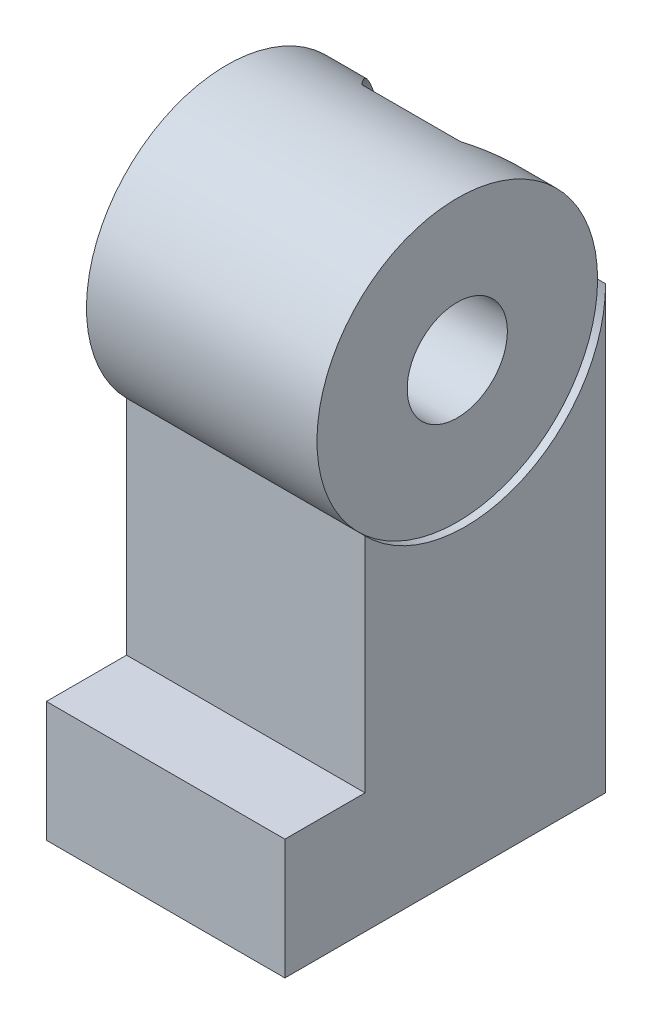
ISO-10303-21;
HEADER;
FILE_DESCRIPTION(('STEP AP214'),'2;1');
FILE_NAME('part.step','',(''),(''),'','','');
FILE_SCHEMA(('AUTOMOTIVE_DESIGN { 1 0 10303 214 1 1 1 1 }'));
ENDSEC;
DATA;
#1=APPLICATION_CONTEXT('core data for automotive mechanical design processes');
#2=APPLICATION_PROTOCOL_DEFINITION('international standard','automotive_design',2000,#1);
#3=PRODUCT_CONTEXT('',#1,'mechanical');
#4=PRODUCT('Part','Part','',(#3));
#5=PRODUCT_RELATED_PRODUCT_CATEGORY('part','',(#4));
#6=PRODUCT_DEFINITION_FORMATION('','',#4);
#7=PRODUCT_DEFINITION_CONTEXT('part definition',#1,'design');
#8=PRODUCT_DEFINITION('design','',#6,#7);
#9=PRODUCT_DEFINITION_SHAPE('','',#8);
#10=(LENGTH_UNIT() NAMED_UNIT(*) SI_UNIT(.MILLI.,.METRE.));
#11=(NAMED_UNIT(*) PLANE_ANGLE_UNIT() SI_UNIT($,.RADIAN.));
#12=(NAMED_UNIT(*) SI_UNIT($,.STERADIAN.) SOLID_ANGLE_UNIT());
#13=UNCERTAINTY_MEASURE_WITH_UNIT(LENGTH_MEASURE(1.E-05),#10,'distance_accuracy_value','');
#14=(GEOMETRIC_REPRESENTATION_CONTEXT(3) GLOBAL_UNCERTAINTY_ASSIGNED_CONTEXT((#13)) GLOBAL_UNIT_ASSIGNED_CONTEXT((#10,
#11,#12)) REPRESENTATION_CONTEXT('',''));
#15=CARTESIAN_POINT('',(0.,0.,0.));
#16=DIRECTION('',(0.,0.,1.));
#17=DIRECTION('',(1.,0.,0.));
#18=AXIS2_PLACEMENT_3D('',#15,#16,#17);
#19=CARTESIAN_POINT('',(-0.725,11.,-0.5));
#20=DIRECTION('',(1.,0.,0.));
#21=DIRECTION('',(0.,1.,0.));
#22=AXIS2_PLACEMENT_3D('',#19,#20,#21);
#23=PLANE('',#22);
#24=CARTESIAN_POINT('',(-0.725,11.,-0.5));
#25=DIRECTION('',(1.,0.,0.));
#26=DIRECTION('',(0.,0.,-1.));
#27=AXIS2_PLACEMENT_3D('',#24,#25,#26);
#28=CIRCLE('',#27,1.25);
#29=CARTESIAN_POINT('',(-0.725,11.,-1.75));
#30=VERTEX_POINT('',#29);
#31=EDGE_CURVE('E196',#30,#30,#28,.T.);
#32=ORIENTED_EDGE('',*,*,#31,.T.);
#33=EDGE_LOOP('',(#32));
#34=FACE_BOUND('',#33,.T.);
#35=ADVANCED_FACE('F17',(#34),#23,.T.);
#36=CARTESIAN_POINT('',(2.775,11.,-0.5));
#37=DIRECTION('',(1.,0.,0.));
#38=DIRECTION('',(0.,1.,0.));
#39=AXIS2_PLACEMENT_3D('',#36,#37,#38);
#40=PLANE('',#39);
#41=CARTESIAN_POINT('',(2.775,11.,-0.5));
#42=DIRECTION('',(1.,0.,0.));
#43=DIRECTION('',(0.,0.,-1.));
#44=AXIS2_PLACEMENT_3D('',#41,#42,#43);
#45=CIRCLE('',#44,1.25);
#46=CARTESIAN_POINT('',(2.775,11.,-1.75));
#47=VERTEX_POINT('',#46);
#48=EDGE_CURVE('E192',#47,#47,#45,.T.);
#49=ORIENTED_EDGE('',*,*,#48,.F.);
#50=EDGE_LOOP('',(#49));
#51=FACE_BOUND('',#50,.T.);
#52=CARTESIAN_POINT('',(2.775,11.,-0.5));
#53=DIRECTION('',(1.,0.,0.));
#54=DIRECTION('',(0.,0.,-1.));
#55=AXIS2_PLACEMENT_3D('',#52,#53,#54);
#56=CIRCLE('',#55,3.5);
#57=CARTESIAN_POINT('',(2.775,11.,-4.));
#58=VERTEX_POINT('',#57);
#59=CARTESIAN_POINT('',(2.775,8.55051025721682,2.));
#60=VERTEX_POINT('',#59);
#61=EDGE_CURVE('E328',#58,#60,#56,.T.);
#62=ORIENTED_EDGE('',*,*,#61,.T.);
#63=CARTESIAN_POINT('',(2.775,11.,-0.5));
#64=DIRECTION('',(1.,0.,0.));
#65=DIRECTION('',(0.,0.,-1.));
#66=AXIS2_PLACEMENT_3D('',#63,#64,#65);
#67=CIRCLE('',#66,3.5);
#68=EDGE_CURVE('E11',#60,#58,#67,.T.);
#69=ORIENTED_EDGE('',*,*,#68,.T.);
#70=EDGE_LOOP('',(#62,#69));
#71=FACE_BOUND('',#70,.T.);
#72=ADVANCED_FACE('F19',(#51,#71),#40,.T.);
#73=CARTESIAN_POINT('',(2.775,11.,-0.5));
#74=DIRECTION('',(1.,0.,0.));
#75=DIRECTION('',(0.,0.,-1.));
#76=AXIS2_PLACEMENT_3D('',#73,#74,#75);
#77=CYLINDRICAL_SURFACE('',#76,3.5);
#78=CARTESIAN_POINT('',(2.975,11.,-0.5));
#79=DIRECTION('',(1.,0.,0.));
#80=DIRECTION('',(0.,0.,-1.));
#81=AXIS2_PLACEMENT_3D('',#78,#79,#80);
#82=CIRCLE('',#81,3.5);
#83=CARTESIAN_POINT('',(2.975,8.55051025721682,2.));
#84=VERTEX_POINT('',#83);
#85=CARTESIAN_POINT('',(2.975,11.,-4.));
#86=VERTEX_POINT('',#85);
#87=EDGE_CURVE('E43',#84,#86,#82,.T.);
#88=ORIENTED_EDGE('',*,*,#87,.T.);
#89=DIRECTION('',(-1.,0.,0.));
#90=VECTOR('',#89,1.);
#91=CARTESIAN_POINT('',(2.975,11.,-4.));
#92=LINE('',#91,#90);
#93=EDGE_CURVE('E206',#86,#58,#92,.T.);
#94=ORIENTED_EDGE('',*,*,#93,.T.);
#95=ORIENTED_EDGE('',*,*,#68,.F.);
#96=DIRECTION('',(-1.,0.,0.));
#97=VECTOR('',#96,1.);
#98=CARTESIAN_POINT('',(2.975,8.55051025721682,2.));
#99=LINE('',#98,#97);
#100=EDGE_CURVE('E151',#84,#60,#99,.T.);
#101=ORIENTED_EDGE('',*,*,#100,.F.);
#102=EDGE_LOOP('',(#88,#94,#95,#101));
#103=FACE_BOUND('',#102,.T.);
#104=ADVANCED_FACE('F152',(#103),#77,.F.);
#105=CARTESIAN_POINT('',(0.,1.8,0.));
#106=DIRECTION('',(0.,-1.,0.));
#107=DIRECTION('',(0.,0.,-1.));
#108=AXIS2_PLACEMENT_3D('',#105,#106,#107);
#109=PLANE('',#108);
#110=DIRECTION('',(0.,0.,-1.));
#111=VECTOR('',#110,1.);
#112=CARTESIAN_POINT('',(0.884166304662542,1.8,-2.2));
#113=LINE('',#112,#111);
#114=CARTESIAN_POINT('',(0.884166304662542,1.8,-2.2));
#115=VERTEX_POINT('',#114);
#116=CARTESIAN_POINT('',(0.884166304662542,1.8,-2.23119921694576));
#117=VERTEX_POINT('',#116);
#118=EDGE_CURVE('E346',#115,#117,#113,.T.);
#119=ORIENTED_EDGE('',*,*,#118,.T.);
#120=CARTESIAN_POINT('',(0.,1.8,0.));
#121=DIRECTION('',(0.,-1.,0.));
#122=DIRECTION('',(0.,0.,-1.));
#123=AXIS2_PLACEMENT_3D('',#120,#121,#122);
#124=CIRCLE('',#123,2.4);
#125=CARTESIAN_POINT('',(-0.95916630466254,1.8,-2.2));
#126=VERTEX_POINT('',#125);
#127=EDGE_CURVE('E393',#117,#126,#124,.T.);
#128=ORIENTED_EDGE('',*,*,#127,.T.);
#129=DIRECTION('',(-1.,0.,0.));
#130=VECTOR('',#129,1.);
#131=CARTESIAN_POINT('',(-0.075,1.8,-2.2));
#132=LINE('',#131,#130);
#133=EDGE_CURVE('E146',#115,#126,#132,.T.);
#134=ORIENTED_EDGE('',*,*,#133,.F.);
#135=EDGE_LOOP('',(#119,#128,#134));
#136=FACE_BOUND('',#135,.T.);
#137=ADVANCED_FACE('F283',(#136),#109,.T.);
#138=CARTESIAN_POINT('',(-0.075,12.,-2.2));
#139=DIRECTION('',(0.,0.,-1.));
#140=DIRECTION('',(0.,1.,0.));
#141=AXIS2_PLACEMENT_3D('',#138,#139,#140);
#142=CYLINDRICAL_SURFACE('',#141,2.4);
#143=CARTESIAN_POINT('',(-0.075,12.,-4.));
#144=DIRECTION('',(0.,0.,-1.));
#145=DIRECTION('',(0.,1.,0.));
#146=AXIS2_PLACEMENT_3D('',#143,#144,#145);
#147=CIRCLE('',#146,2.4);
#148=CARTESIAN_POINT('',(2.10674242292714,11.,-4.));
#149=VERTEX_POINT('',#148);
#150=CARTESIAN_POINT('',(-2.25674242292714,11.,-4.));
#151=VERTEX_POINT('',#150);
#152=EDGE_CURVE('E209',#149,#151,#147,.T.);
#153=ORIENTED_EDGE('',*,*,#152,.T.);
#154=CARTESIAN_POINT('',(-1.30740554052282,14.0594117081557,-2.20000000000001));
#155=CARTESIAN_POINT('',(-1.36158248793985,14.0269931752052,-2.25834282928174));
#156=CARTESIAN_POINT('',(-1.41458958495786,13.9924466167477,-2.31658269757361));
#157=CARTESIAN_POINT('',(-1.4919223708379,13.9375250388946,-2.4031808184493));
#158=CARTESIAN_POINT('',(-1.51719657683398,13.9188181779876,-2.43175633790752));
#159=CARTESIAN_POINT('',(-1.5669283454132,13.8804474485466,-2.48851383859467));
#160=CARTESIAN_POINT('',(-1.59139053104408,13.8607915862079,-2.51669716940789));
#161=CARTESIAN_POINT('',(-1.63949776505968,13.8205257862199,-2.57263443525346));
#162=CARTESIAN_POINT('',(-1.66314734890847,13.7999235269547,-2.60038999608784));
#163=CARTESIAN_POINT('',(-1.70962996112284,13.7577687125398,-2.65543624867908));
#164=CARTESIAN_POINT('',(-1.73246741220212,13.7362234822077,-2.68272881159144));
#165=CARTESIAN_POINT('',(-1.77732451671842,13.6921872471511,-2.73681381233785));
#166=CARTESIAN_POINT('',(-1.79934847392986,13.6697031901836,-2.76360833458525));
#167=CARTESIAN_POINT('',(-1.84258362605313,13.6237979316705,-2.81665867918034));
#168=CARTESIAN_POINT('',(-1.86379894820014,13.6003832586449,-2.84291678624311));
#169=CARTESIAN_POINT('',(-1.90755233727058,13.5501437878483,-2.89755608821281));
#170=CARTESIAN_POINT('',(-1.93001769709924,13.523209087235,-2.92589467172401));
#171=CARTESIAN_POINT('',(-1.97357010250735,13.4685674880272,-2.98146380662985));
#172=CARTESIAN_POINT('',(-1.99467560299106,13.4408863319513,-3.0087051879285));
#173=CARTESIAN_POINT('',(-2.03551352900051,13.3848038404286,-3.0620654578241));
#174=CARTESIAN_POINT('',(-2.05526473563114,13.3564271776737,-3.08819587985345));
#175=CARTESIAN_POINT('',(-2.09339216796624,13.2990028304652,-3.13932475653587));
#176=CARTESIAN_POINT('',(-2.11178758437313,13.2699786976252,-3.16433532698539));
#177=CARTESIAN_POINT('',(-2.14720344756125,13.2113088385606,-3.21321639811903));
#178=CARTESIAN_POINT('',(-2.16424338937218,13.1816854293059,-3.23709953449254));
#179=CARTESIAN_POINT('',(-2.19694795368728,13.1218658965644,-3.28371983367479));
#180=CARTESIAN_POINT('',(-2.21263229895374,13.0916907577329,-3.30647006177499));
#181=CARTESIAN_POINT('',(-2.24262535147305,13.0308159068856,-3.35082074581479));
#182=CARTESIAN_POINT('',(-2.25695390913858,13.0001357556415,-3.37243459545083));
#183=CARTESIAN_POINT('',(-2.28423581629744,12.9382993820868,-3.41451011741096));
#184=CARTESIAN_POINT('',(-2.29720901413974,12.9071611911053,-3.43498541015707));
#185=CARTESIAN_POINT('',(-2.32369815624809,12.8395530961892,-3.47789533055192));
#186=CARTESIAN_POINT('',(-2.33704240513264,12.8029399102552,-3.5002109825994));
#187=CARTESIAN_POINT('',(-2.36185767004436,12.7292339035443,-3.54327715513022));
#188=CARTESIAN_POINT('',(-2.37336041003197,12.6921647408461,-3.56404984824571));
#189=CARTESIAN_POINT('',(-2.39449424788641,12.6176193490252,-3.60403980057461));
#190=CARTESIAN_POINT('',(-2.40415624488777,12.5801635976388,-3.62327884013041));
#191=CARTESIAN_POINT('',(-2.42160924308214,12.504916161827,-3.66021409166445));
#192=CARTESIAN_POINT('',(-2.4294299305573,12.4671417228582,-3.67793135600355));
#193=CARTESIAN_POINT('',(-2.44320180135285,12.3913260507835,-3.71183878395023));
#194=CARTESIAN_POINT('',(-2.4491810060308,12.3532988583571,-3.72804891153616));
#195=CARTESIAN_POINT('',(-2.45927149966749,12.2770444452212,-3.75896075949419));
#196=CARTESIAN_POINT('',(-2.463408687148,12.2388281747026,-3.77368098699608));
#197=CARTESIAN_POINT('',(-2.46981822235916,12.1622611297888,-3.80163424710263));
#198=CARTESIAN_POINT('',(-2.47211386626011,12.1239184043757,-3.81488396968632));
#199=CARTESIAN_POINT('',(-2.47484022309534,12.0471577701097,-3.83992094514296));
#200=CARTESIAN_POINT('',(-2.47529122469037,12.0087453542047,-3.85172271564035));
#201=CARTESIAN_POINT('',(-2.47455765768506,11.9493731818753,-3.86885126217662));
#202=CARTESIAN_POINT('',(-2.4740317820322,11.9285391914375,-3.87465292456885));
#203=CARTESIAN_POINT('',(-2.47244212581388,11.8869140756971,-3.88583000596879));
#204=CARTESIAN_POINT('',(-2.47138166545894,11.8661234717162,-3.89120782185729));
#205=CARTESIAN_POINT('',(-2.46872166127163,11.8245952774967,-3.90154347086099));
#206=CARTESIAN_POINT('',(-2.46712513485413,11.8038580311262,-3.90650346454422));
#207=CARTESIAN_POINT('',(-2.46339370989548,11.7624453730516,-3.91601026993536));
#208=CARTESIAN_POINT('',(-2.461261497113,11.7417701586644,-3.92055899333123));
#209=CARTESIAN_POINT('',(-2.4564589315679,11.700490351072,-3.92925010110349));
#210=CARTESIAN_POINT('',(-2.45379091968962,11.6798858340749,-3.93339414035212));
#211=CARTESIAN_POINT('',(-2.44791713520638,11.6387558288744,-3.94128288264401));
#212=CARTESIAN_POINT('',(-2.44471334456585,11.6182303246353,-3.94502897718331));
#213=CARTESIAN_POINT('',(-2.43776835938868,11.5772664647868,-3.95212894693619));
#214=CARTESIAN_POINT('',(-2.43402877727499,11.5568280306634,-3.95548394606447));
#215=CARTESIAN_POINT('',(-2.42601258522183,11.5160461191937,-3.96180895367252));
#216=CARTESIAN_POINT('',(-2.4217372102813,11.4957025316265,-3.96477981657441));
#217=CARTESIAN_POINT('',(-2.41264981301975,11.455117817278,-3.97034387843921));
#218=CARTESIAN_POINT('',(-2.40783864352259,11.4348765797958,-3.9729376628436));
#219=CARTESIAN_POINT('',(-2.39768004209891,11.3945037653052,-3.97775498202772));
#220=CARTESIAN_POINT('',(-2.39233307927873,11.374372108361,-3.97997883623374));
#221=CARTESIAN_POINT('',(-2.38110327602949,11.3342253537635,-3.98406378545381));
#222=CARTESIAN_POINT('',(-2.37522052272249,11.3142102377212,-3.98592493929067));
#223=CARTESIAN_POINT('',(-2.36291952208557,11.2743031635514,-3.98929204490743));
#224=CARTESIAN_POINT('',(-2.35650098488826,11.254411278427,-3.99079780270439));
#225=CARTESIAN_POINT('',(-2.3431287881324,11.2147569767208,-3.99346172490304));
#226=CARTESIAN_POINT('',(-2.33617446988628,11.1949947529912,-3.99461945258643));
#227=CARTESIAN_POINT('',(-2.32173109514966,11.155605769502,-3.99659498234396));
#228=CARTESIAN_POINT('',(-2.31424102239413,11.1359793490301,-3.99741211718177));
#229=CARTESIAN_POINT('',(-2.29872642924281,11.0968677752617,-3.9987141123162));
#230=CARTESIAN_POINT('',(-2.29070054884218,11.0773831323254,-3.99919808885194));
#231=CARTESIAN_POINT('',(-2.27411492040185,11.0385602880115,-3.99984164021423));
#232=CARTESIAN_POINT('',(-2.26555348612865,11.0192227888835,-4.00000013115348));
#233=CARTESIAN_POINT('',(-2.25674242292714,11.,-4.));
#234=B_SPLINE_CURVE_WITH_KNOTS('',3,(#154,#155,#156,#157,#158,#159,#160,#161,#162,#163,#164,
#165,#166,#167,#168,#169,#170,#171,#172,#173,#174,#175,#176,#177,#178,#179,#180,#181,#182,#183,
#184,#185,#186,#187,#188,#189,#190,#191,#192,#193,#194,#195,#196,#197,#198,#199,#200,#201,#202,
#203,#204,#205,#206,#207,#208,#209,#210,#211,#212,#213,#214,#215,#216,#217,#218,#219,#220,#221,
#222,#223,#224,#225,#226,#227,#228,#229,#230,#231,#232,#233),.UNSPECIFIED.,.F.,.F.,(4,2,2,2,2,2,
2,2,2,2,2,2,2,2,2,2,2,2,2,2,2,2,2,2,2,2,2,2,2,2,2,2,2,2,2,2,2,2,2,4),(0.,0.257838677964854,
0.385287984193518,0.51180451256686,0.637431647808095,0.76221370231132,0.88619589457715,
1.00942432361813,1.1446673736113,1.27724044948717,1.40722073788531,1.53469013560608,
1.65973547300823,1.78244872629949,1.90292721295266,2.02127376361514,2.15593392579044,
2.28794127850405,2.41748725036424,2.54477437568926,2.67001614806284,2.79343667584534,
2.91527011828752,3.03575988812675,3.10065028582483,3.16514253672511,3.22927769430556,
3.2930975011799,3.35664432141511,3.41996106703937,3.48309111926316,3.54607824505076,
3.60896650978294,3.67180018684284,3.73462366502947,3.79748135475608,3.8604175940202,
3.92347655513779,3.98670215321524,4.05013795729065),.UNSPECIFIED.);
#235=CARTESIAN_POINT('',(-1.30740554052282,14.0594117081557,-2.2));
#236=VERTEX_POINT('',#235);
#237=EDGE_CURVE('E226',#236,#151,#234,.T.);
#238=ORIENTED_EDGE('',*,*,#237,.F.);
#239=CARTESIAN_POINT('',(-0.075,12.,-2.2));
#240=DIRECTION('',(0.,0.,-1.));
#241=DIRECTION('',(0.,1.,0.));
#242=AXIS2_PLACEMENT_3D('',#239,#240,#241);
#243=CIRCLE('',#242,2.4);
#244=CARTESIAN_POINT('',(1.15740554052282,14.0594117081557,-2.2));
#245=VERTEX_POINT('',#244);
#246=EDGE_CURVE('E28',#245,#236,#243,.T.);
#247=ORIENTED_EDGE('',*,*,#246,.F.);
#248=CARTESIAN_POINT('',(2.10674242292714,11.,-4.));
#249=CARTESIAN_POINT('',(2.11554270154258,11.0191992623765,-4.00000013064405));
#250=CARTESIAN_POINT('',(2.12409390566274,11.0385129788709,-3.99984202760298));
#251=CARTESIAN_POINT('',(2.14066040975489,11.077288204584,-3.99920005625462));
#252=CARTESIAN_POINT('',(2.14867738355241,11.0967490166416,-3.99871726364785));
#253=CARTESIAN_POINT('',(2.16417549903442,11.1358128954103,-3.99741845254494));
#254=CARTESIAN_POINT('',(2.17165798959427,11.155415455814,-3.99660331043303));
#255=CARTESIAN_POINT('',(2.18608753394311,11.1947567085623,-3.994632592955));
#256=CARTESIAN_POINT('',(2.19303559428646,11.2144950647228,-3.99347767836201));
#257=CARTESIAN_POINT('',(2.20639660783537,11.2541016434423,-3.99082021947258));
#258=CARTESIAN_POINT('',(2.2128102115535,11.2739696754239,-3.98931810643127));
#259=CARTESIAN_POINT('',(2.22510267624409,11.3138290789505,-3.98595913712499));
#260=CARTESIAN_POINT('',(2.230981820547,11.3338203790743,-3.98410247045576));
#261=CARTESIAN_POINT('',(2.2422057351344,11.373919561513,-3.98002735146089));
#262=CARTESIAN_POINT('',(2.24755041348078,11.3940274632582,-3.9778088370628));
#263=CARTESIAN_POINT('',(2.25770577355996,11.434352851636,-3.97300306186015));
#264=CARTESIAN_POINT('',(2.26251598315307,11.4545704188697,-3.97041547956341));
#265=CARTESIAN_POINT('',(2.27160278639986,11.4951079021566,-3.96486469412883));
#266=CARTESIAN_POINT('',(2.27587852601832,11.5154279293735,-3.96190090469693));
#267=CARTESIAN_POINT('',(2.28389677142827,11.5561628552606,-3.95559092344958));
#268=CARTESIAN_POINT('',(2.28763804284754,11.5765778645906,-3.95224387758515));
#269=CARTESIAN_POINT('',(2.29458772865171,11.6174950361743,-3.94516070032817));
#270=CARTESIAN_POINT('',(2.29779453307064,11.6379972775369,-3.94142344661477));
#271=CARTESIAN_POINT('',(2.30367566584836,11.6790809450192,-3.93355327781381));
#272=CARTESIAN_POINT('',(2.30634801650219,11.6996623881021,-3.92941897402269));
#273=CARTESIAN_POINT('',(2.31116057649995,11.7408962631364,-3.92074823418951));
#274=CARTESIAN_POINT('',(2.31329845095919,11.7615486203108,-3.91621014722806));
#275=CARTESIAN_POINT('',(2.31704252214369,11.8029158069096,-3.90672551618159));
#276=CARTESIAN_POINT('',(2.31864604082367,11.8236304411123,-3.9017770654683));
#277=CARTESIAN_POINT('',(2.32132132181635,11.8651136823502,-3.89146540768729));
#278=CARTESIAN_POINT('',(2.32239007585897,11.8858819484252,-3.88610004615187));
#279=CARTESIAN_POINT('',(2.32399771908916,11.9274626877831,-3.87494878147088));
#280=CARTESIAN_POINT('',(2.32453329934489,11.948274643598,-3.86916048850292));
#281=CARTESIAN_POINT('',(2.32529592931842,12.0075865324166,-3.85207073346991));
#282=CARTESIAN_POINT('',(2.32486532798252,12.0459614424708,-3.84029527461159));
#283=CARTESIAN_POINT('',(2.32218223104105,12.122649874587,-3.81531327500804));
#284=CARTESIAN_POINT('',(2.3199094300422,12.1609579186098,-3.80209221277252));
#285=CARTESIAN_POINT('',(2.31354823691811,12.2374585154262,-3.77419845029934));
#286=CARTESIAN_POINT('',(2.30943654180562,12.275643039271,-3.75950905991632));
#287=CARTESIAN_POINT('',(2.2993996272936,12.3518369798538,-3.72866087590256));
#288=CARTESIAN_POINT('',(2.29344850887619,12.3898354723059,-3.71248357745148));
#289=CARTESIAN_POINT('',(2.27973540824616,12.4655968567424,-3.6786436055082));
#290=CARTESIAN_POINT('',(2.27194541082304,12.5033457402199,-3.66096097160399));
#291=CARTESIAN_POINT('',(2.25455639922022,12.578545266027,-3.62409657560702));
#292=CARTESIAN_POINT('',(2.24492771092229,12.6159787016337,-3.60489376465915));
#293=CARTESIAN_POINT('',(2.22386301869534,12.690482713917,-3.56497767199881));
#294=CARTESIAN_POINT('',(2.21239613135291,12.7275328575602,-3.54424261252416));
#295=CARTESIAN_POINT('',(2.18765537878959,12.8012042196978,-3.50125284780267));
#296=CARTESIAN_POINT('',(2.17434981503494,12.8378018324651,-3.47897596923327));
#297=CARTESIAN_POINT('',(2.14794724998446,12.9053504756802,-3.4361603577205));
#298=CARTESIAN_POINT('',(2.13502304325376,12.9364454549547,-3.41574138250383));
#299=CARTESIAN_POINT('',(2.10784186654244,12.9981995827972,-3.37378095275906));
#300=CARTESIAN_POINT('',(2.09356506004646,13.028840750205,-3.35222589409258));
#301=CARTESIAN_POINT('',(2.06367850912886,13.0896419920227,-3.30799498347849));
#302=CARTESIAN_POINT('',(2.04804893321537,13.1197825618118,-3.28530575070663));
#303=CARTESIAN_POINT('',(2.0154568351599,13.1795373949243,-3.23880942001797));
#304=CARTESIAN_POINT('',(1.99847460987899,13.2091307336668,-3.21498926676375));
#305=CARTESIAN_POINT('',(1.96317712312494,13.2677449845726,-3.16623590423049));
#306=CARTESIAN_POINT('',(1.94484238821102,13.2967436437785,-3.14129006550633));
#307=CARTESIAN_POINT('',(1.90683926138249,13.3541216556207,-3.0902921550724));
#308=CARTESIAN_POINT('',(1.88715170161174,13.3824775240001,-3.06422796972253));
#309=CARTESIAN_POINT('',(1.84644398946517,13.4385231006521,-3.01100143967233));
#310=CARTESIAN_POINT('',(1.82540507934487,13.4661882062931,-2.98382755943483));
#311=CARTESIAN_POINT('',(1.78198886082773,13.5208024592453,-2.92839441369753));
#312=CARTESIAN_POINT('',(1.75959312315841,13.5477259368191,-2.90012431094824));
#313=CARTESIAN_POINT('',(1.7158568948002,13.5980834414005,-2.84546905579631));
#314=CARTESIAN_POINT('',(1.69458495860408,13.6216209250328,-2.81912416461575));
#315=CARTESIAN_POINT('',(1.65122767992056,13.6677662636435,-2.76589308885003));
#316=CARTESIAN_POINT('',(1.62913810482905,13.6903674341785,-2.73900455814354));
#317=CARTESIAN_POINT('',(1.58414090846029,13.7346321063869,-2.68472464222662));
#318=CARTESIAN_POINT('',(1.56122887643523,13.7562884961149,-2.65733111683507));
#319=CARTESIAN_POINT('',(1.51458823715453,13.7986595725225,-2.60207635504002));
#320=CARTESIAN_POINT('',(1.49085509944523,13.8193667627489,-2.57421319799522));
#321=CARTESIAN_POINT('',(1.44257189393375,13.8598361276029,-2.51805446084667));
#322=CARTESIAN_POINT('',(1.41801718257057,13.8795904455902,-2.48975721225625));
#323=CARTESIAN_POINT('',(1.36809150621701,13.9181515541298,-2.43276592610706));
#324=CARTESIAN_POINT('',(1.34271581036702,13.9369501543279,-2.40407050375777));
#325=CARTESIAN_POINT('',(1.26505988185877,13.9921408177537,-2.31709813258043));
#326=CARTESIAN_POINT('',(1.21182245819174,14.0268495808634,-2.25860122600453));
#327=CARTESIAN_POINT('',(1.15740554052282,14.0594117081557,-2.20000000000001));
#328=B_SPLINE_CURVE_WITH_KNOTS('',3,(#248,#249,#250,#251,#252,#253,#254,#255,#256,#257,#258,
#259,#260,#261,#262,#263,#264,#265,#266,#267,#268,#269,#270,#271,#272,#273,#274,#275,#276,#277,
#278,#279,#280,#281,#282,#283,#284,#285,#286,#287,#288,#289,#290,#291,#292,#293,#294,#295,#296,
#297,#298,#299,#300,#301,#302,#303,#304,#305,#306,#307,#308,#309,#310,#311,#312,#313,#314,#315,
#316,#317,#318,#319,#320,#321,#322,#323,#324,#325,#326,#327),.UNSPECIFIED.,.F.,.F.,(4,2,2,2,2,2,
2,2,2,2,2,2,2,2,2,2,2,2,2,2,2,2,2,2,2,2,2,2,2,2,2,2,2,2,2,2,2,2,2,4),(0.,0.0633581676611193,
0.126507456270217,0.189491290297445,0.252353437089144,0.315137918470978,0.377888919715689,
0.4406506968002,0.503467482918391,0.566383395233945,0.629442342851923,0.692687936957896,
0.756163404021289,0.819911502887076,0.883974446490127,0.948393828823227,1.01321055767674,
1.1335690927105,1.25527260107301,1.37856410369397,1.50367736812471,1.63083611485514,
1.76025345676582,1.89213155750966,2.02666148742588,2.14476994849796,2.26500902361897,
2.38748125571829,2.51228368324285,2.63950801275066,2.76924081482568,2.90156373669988,
3.03655372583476,3.16024600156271,3.28470678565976,3.4099828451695,3.53612004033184,
3.6631632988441,3.79115659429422,4.05013689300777),.UNSPECIFIED.);
#329=EDGE_CURVE('E264',#149,#245,#328,.T.);
#330=ORIENTED_EDGE('',*,*,#329,.F.);
#331=EDGE_LOOP('',(#153,#238,#247,#330));
#332=FACE_BOUND('',#331,.T.);
#333=ADVANCED_FACE('F272',(#332),#142,.F.);
#334=CARTESIAN_POINT('',(-0.075,12.,-2.2));
#335=DIRECTION('',(0.,0.,-1.));
#336=DIRECTION('',(-1.,0.,0.));
#337=AXIS2_PLACEMENT_3D('',#334,#335,#336);
#338=PLANE('',#337);
#339=DIRECTION('',(1.,0.,0.));
#340=VECTOR('',#339,1.);
#341=CARTESIAN_POINT('',(2.975,14.0594117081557,-2.2));
#342=LINE('',#341,#340);
#343=EDGE_CURVE('E298',#236,#245,#342,.T.);
#344=ORIENTED_EDGE('',*,*,#343,.T.);
#345=ORIENTED_EDGE('',*,*,#246,.T.);
#346=EDGE_LOOP('',(#344,#345));
#347=FACE_BOUND('',#346,.T.);
#348=ADVANCED_FACE('F282',(#347),#338,.T.);
#349=CARTESIAN_POINT('',(-0.075,4.,-2.2));
#350=DIRECTION('',(0.,0.,-1.));
#351=DIRECTION('',(-1.,0.,0.));
#352=AXIS2_PLACEMENT_3D('',#349,#350,#351);
#353=PLANE('',#352);
#354=DIRECTION('',(0.,1.,0.));
#355=VECTOR('',#354,1.);
#356=CARTESIAN_POINT('',(-0.95916630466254,1.8,-2.2));
#357=LINE('',#356,#355);
#358=CARTESIAN_POINT('',(-0.95916630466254,1.76880078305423,-2.2));
#359=VERTEX_POINT('',#358);
#360=EDGE_CURVE('E389',#359,#126,#357,.T.);
#361=ORIENTED_EDGE('',*,*,#360,.F.);
#362=CARTESIAN_POINT('',(-0.075,4.,-2.2));
#363=DIRECTION('',(0.,0.,-1.));
#364=DIRECTION('',(0.,1.,0.));
#365=AXIS2_PLACEMENT_3D('',#362,#363,#364);
#366=CIRCLE('',#365,2.4);
#367=EDGE_CURVE('E356',#359,#115,#366,.T.);
#368=ORIENTED_EDGE('',*,*,#367,.T.);
#369=ORIENTED_EDGE('',*,*,#133,.T.);
#370=EDGE_LOOP('',(#361,#368,#369));
#371=FACE_BOUND('',#370,.T.);
#372=ADVANCED_FACE('F444',(#371),#353,.T.);
#373=CARTESIAN_POINT('',(-2.975,11.,-0.5));
#374=DIRECTION('',(1.,0.,0.));
#375=DIRECTION('',(0.,1.,0.));
#376=AXIS2_PLACEMENT_3D('',#373,#374,#375);
#377=PLANE('',#376);
#378=CARTESIAN_POINT('',(-2.975,11.,-0.5));
#379=DIRECTION('',(1.,0.,0.));
#380=DIRECTION('',(0.,0.,-1.));
#381=AXIS2_PLACEMENT_3D('',#378,#379,#380);
#382=CIRCLE('',#381,3.5);
#383=CARTESIAN_POINT('',(-2.975,11.,-4.));
#384=VERTEX_POINT('',#383);
#385=CARTESIAN_POINT('',(-2.975,8.55051025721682,2.));
#386=VERTEX_POINT('',#385);
#387=EDGE_CURVE('E183',#384,#386,#382,.T.);
#388=ORIENTED_EDGE('',*,*,#387,.F.);
#389=DIRECTION('',(0.,1.,0.));
#390=VECTOR('',#389,1.);
#391=CARTESIAN_POINT('',(-2.975,11.,-4.));
#392=LINE('',#391,#390);
#393=CARTESIAN_POINT('',(-2.975,0.,-4.));
#394=VERTEX_POINT('',#393);
#395=EDGE_CURVE('E147',#394,#384,#392,.T.);
#396=ORIENTED_EDGE('',*,*,#395,.F.);
#397=DIRECTION('',(0.,0.,-1.));
#398=VECTOR('',#397,1.);
#399=CARTESIAN_POINT('',(-2.975,0.,-4.));
#400=LINE('',#399,#398);
#401=CARTESIAN_POINT('',(-2.975,0.,4.));
#402=VERTEX_POINT('',#401);
#403=EDGE_CURVE('E213',#402,#394,#400,.T.);
#404=ORIENTED_EDGE('',*,*,#403,.F.);
#405=DIRECTION('',(0.,-1.,0.));
#406=VECTOR('',#405,1.);
#407=CARTESIAN_POINT('',(-2.975,0.,4.));
#408=LINE('',#407,#406);
#409=CARTESIAN_POINT('',(-2.975,3.,4.));
#410=VERTEX_POINT('',#409);
#411=EDGE_CURVE('E176',#410,#402,#408,.T.);
#412=ORIENTED_EDGE('',*,*,#411,.F.);
#413=DIRECTION('',(0.,0.,1.));
#414=VECTOR('',#413,1.);
#415=CARTESIAN_POINT('',(-2.975,3.,4.));
#416=LINE('',#415,#414);
#417=CARTESIAN_POINT('',(-2.975,3.,2.));
#418=VERTEX_POINT('',#417);
#419=EDGE_CURVE('E157',#418,#410,#416,.T.);
#420=ORIENTED_EDGE('',*,*,#419,.F.);
#421=DIRECTION('',(0.,-1.,0.));
#422=VECTOR('',#421,1.);
#423=CARTESIAN_POINT('',(-2.975,3.,2.));
#424=LINE('',#423,#422);
#425=EDGE_CURVE('E170',#386,#418,#424,.T.);
#426=ORIENTED_EDGE('',*,*,#425,.F.);
#427=EDGE_LOOP('',(#388,#396,#404,#412,#420,#426));
#428=FACE_BOUND('',#427,.T.);
#429=ADVANCED_FACE('F490',(#428),#377,.F.);
#430=CARTESIAN_POINT('',(2.975,11.,-0.5));
#431=DIRECTION('',(1.,0.,0.));
#432=DIRECTION('',(0.,1.,0.));
#433=AXIS2_PLACEMENT_3D('',#430,#431,#432);
#434=PLANE('',#433);
#435=ORIENTED_EDGE('',*,*,#87,.F.);
#436=DIRECTION('',(0.,-1.,0.));
#437=VECTOR('',#436,1.);
#438=CARTESIAN_POINT('',(2.975,3.,2.));
#439=LINE('',#438,#437);
#440=CARTESIAN_POINT('',(2.975,3.,2.));
#441=VERTEX_POINT('',#440);
#442=EDGE_CURVE('E140',#84,#441,#439,.T.);
#443=ORIENTED_EDGE('',*,*,#442,.T.);
#444=DIRECTION('',(0.,0.,1.));
#445=VECTOR('',#444,1.);
#446=CARTESIAN_POINT('',(2.975,3.,4.));
#447=LINE('',#446,#445);
#448=CARTESIAN_POINT('',(2.975,3.,4.));
#449=VERTEX_POINT('',#448);
#450=EDGE_CURVE('E180',#441,#449,#447,.T.);
#451=ORIENTED_EDGE('',*,*,#450,.T.);
#452=DIRECTION('',(0.,-1.,0.));
#453=VECTOR('',#452,1.);
#454=CARTESIAN_POINT('',(2.975,0.,4.));
#455=LINE('',#454,#453);
#456=CARTESIAN_POINT('',(2.975,0.,4.));
#457=VERTEX_POINT('',#456);
#458=EDGE_CURVE('E187',#449,#457,#455,.T.);
#459=ORIENTED_EDGE('',*,*,#458,.T.);
#460=DIRECTION('',(0.,0.,-1.));
#461=VECTOR('',#460,1.);
#462=CARTESIAN_POINT('',(2.975,0.,-4.));
#463=LINE('',#462,#461);
#464=CARTESIAN_POINT('',(2.975,0.,-4.));
#465=VERTEX_POINT('',#464);
#466=EDGE_CURVE('E216',#457,#465,#463,.T.);
#467=ORIENTED_EDGE('',*,*,#466,.T.);
#468=DIRECTION('',(0.,1.,0.));
#469=VECTOR('',#468,1.);
#470=CARTESIAN_POINT('',(2.975,11.,-4.));
#471=LINE('',#470,#469);
#472=EDGE_CURVE('E143',#465,#86,#471,.T.);
#473=ORIENTED_EDGE('',*,*,#472,.T.);
#474=EDGE_LOOP('',(#435,#443,#451,#459,#467,#473));
#475=FACE_BOUND('',#474,.T.);
#476=ADVANCED_FACE('F137',(#475),#434,.T.);
#477=CARTESIAN_POINT('',(2.975,11.,-4.));
#478=DIRECTION('',(0.,0.,1.));
#479=DIRECTION('',(0.,-1.,0.));
#480=AXIS2_PLACEMENT_3D('',#477,#478,#479);
#481=PLANE('',#480);
#482=CARTESIAN_POINT('',(-0.075,4.,-4.));
#483=DIRECTION('',(0.,0.,-1.));
#484=DIRECTION('',(0.,1.,0.));
#485=AXIS2_PLACEMENT_3D('',#482,#483,#484);
#486=CIRCLE('',#485,2.4);
#487=CARTESIAN_POINT('',(-0.075,6.4,-4.));
#488=VERTEX_POINT('',#487);
#489=EDGE_CURVE('E174',#488,#488,#486,.T.);
#490=ORIENTED_EDGE('',*,*,#489,.F.);
#491=EDGE_LOOP('',(#490));
#492=FACE_BOUND('',#491,.T.);
#493=DIRECTION('',(-1.,0.,0.));
#494=VECTOR('',#493,1.);
#495=CARTESIAN_POINT('',(2.975,11.,-4.));
#496=LINE('',#495,#494);
#497=EDGE_CURVE('E308',#151,#384,#496,.T.);
#498=ORIENTED_EDGE('',*,*,#497,.F.);
#499=ORIENTED_EDGE('',*,*,#152,.F.);
#500=DIRECTION('',(-1.,0.,0.));
#501=VECTOR('',#500,1.);
#502=CARTESIAN_POINT('',(2.975,11.,-4.));
#503=LINE('',#502,#501);
#504=EDGE_CURVE('E270',#58,#149,#503,.T.);
#505=ORIENTED_EDGE('',*,*,#504,.F.);
#506=ORIENTED_EDGE('',*,*,#93,.F.);
#507=ORIENTED_EDGE('',*,*,#472,.F.);
#508=DIRECTION('',(-1.,0.,0.));
#509=VECTOR('',#508,1.);
#510=CARTESIAN_POINT('',(2.975,0.,-4.));
#511=LINE('',#510,#509);
#512=EDGE_CURVE('E219',#465,#394,#511,.T.);
#513=ORIENTED_EDGE('',*,*,#512,.T.);
#514=ORIENTED_EDGE('',*,*,#395,.T.);
#515=EDGE_LOOP('',(#498,#499,#505,#506,#507,#513,#514));
#516=FACE_BOUND('',#515,.T.);
#517=ADVANCED_FACE('F245',(#492,#516),#481,.F.);
#518=CARTESIAN_POINT('',(2.975,0.,-4.));
#519=DIRECTION('',(0.,1.,0.));
#520=DIRECTION('',(0.,0.,-1.));
#521=AXIS2_PLACEMENT_3D('',#518,#519,#520);
#522=PLANE('',#521);
#523=CARTESIAN_POINT('',(0.,0.,0.));
#524=DIRECTION('',(0.,-1.,0.));
#525=DIRECTION('',(0.,0.,-1.));
#526=AXIS2_PLACEMENT_3D('',#523,#524,#525);
#527=CIRCLE('',#526,2.4);
#528=CARTESIAN_POINT('',(0.,0.,-2.4));
#529=VERTEX_POINT('',#528);
#530=EDGE_CURVE('E360',#529,#529,#527,.T.);
#531=ORIENTED_EDGE('',*,*,#530,.F.);
#532=EDGE_LOOP('',(#531));
#533=FACE_BOUND('',#532,.T.);
#534=ORIENTED_EDGE('',*,*,#403,.T.);
#535=ORIENTED_EDGE('',*,*,#512,.F.);
#536=ORIENTED_EDGE('',*,*,#466,.F.);
#537=DIRECTION('',(-1.,0.,0.));
#538=VECTOR('',#537,1.);
#539=CARTESIAN_POINT('',(2.975,0.,4.));
#540=LINE('',#539,#538);
#541=EDGE_CURVE('E179',#457,#402,#540,.T.);
#542=ORIENTED_EDGE('',*,*,#541,.T.);
#543=EDGE_LOOP('',(#534,#535,#536,#542));
#544=FACE_BOUND('',#543,.T.);
#545=ADVANCED_FACE('F481',(#533,#544),#522,.F.);
#546=CARTESIAN_POINT('',(2.975,0.,4.));
#547=DIRECTION('',(0.,0.,-1.));
#548=DIRECTION('',(0.,-1.,0.));
#549=AXIS2_PLACEMENT_3D('',#546,#547,#548);
#550=PLANE('',#549);
#551=ORIENTED_EDGE('',*,*,#411,.T.);
#552=ORIENTED_EDGE('',*,*,#541,.F.);
#553=ORIENTED_EDGE('',*,*,#458,.F.);
#554=DIRECTION('',(-1.,0.,0.));
#555=VECTOR('',#554,1.);
#556=CARTESIAN_POINT('',(2.975,3.,4.));
#557=LINE('',#556,#555);
#558=EDGE_CURVE('E191',#449,#410,#557,.T.);
#559=ORIENTED_EDGE('',*,*,#558,.T.);
#560=EDGE_LOOP('',(#551,#552,#553,#559));
#561=FACE_BOUND('',#560,.T.);
#562=ADVANCED_FACE('F477',(#561),#550,.F.);
#563=CARTESIAN_POINT('',(2.975,3.,4.));
#564=DIRECTION('',(0.,-1.,0.));
#565=DIRECTION('',(0.,0.,-1.));
#566=AXIS2_PLACEMENT_3D('',#563,#564,#565);
#567=PLANE('',#566);
#568=ORIENTED_EDGE('',*,*,#419,.T.);
#569=ORIENTED_EDGE('',*,*,#558,.F.);
#570=ORIENTED_EDGE('',*,*,#450,.F.);
#571=DIRECTION('',(-1.,0.,0.));
#572=VECTOR('',#571,1.);
#573=CARTESIAN_POINT('',(2.975,3.,2.));
#574=LINE('',#573,#572);
#575=EDGE_CURVE('E162',#441,#418,#574,.T.);
#576=ORIENTED_EDGE('',*,*,#575,.T.);
#577=EDGE_LOOP('',(#568,#569,#570,#576));
#578=FACE_BOUND('',#577,.T.);
#579=ADVANCED_FACE('F243',(#578),#567,.F.);
#580=CARTESIAN_POINT('',(2.975,3.,2.));
#581=DIRECTION('',(0.,0.,-1.));
#582=DIRECTION('',(0.,-1.,0.));
#583=AXIS2_PLACEMENT_3D('',#580,#581,#582);
#584=PLANE('',#583);
#585=ORIENTED_EDGE('',*,*,#425,.T.);
#586=ORIENTED_EDGE('',*,*,#575,.F.);
#587=ORIENTED_EDGE('',*,*,#442,.F.);
#588=ORIENTED_EDGE('',*,*,#100,.T.);
#589=DIRECTION('',(-1.,0.,0.));
#590=VECTOR('',#589,1.);
#591=CARTESIAN_POINT('',(2.975,8.55051025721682,2.));
#592=LINE('',#591,#590);
#593=EDGE_CURVE('E181',#60,#386,#592,.T.);
#594=ORIENTED_EDGE('',*,*,#593,.T.);
#595=EDGE_LOOP('',(#585,#586,#587,#588,#594));
#596=FACE_BOUND('',#595,.T.);
#597=ADVANCED_FACE('F160',(#596),#584,.F.);
#598=CARTESIAN_POINT('',(2.975,11.,-0.5));
#599=DIRECTION('',(-1.,0.,0.));
#600=DIRECTION('',(0.,0.,1.));
#601=AXIS2_PLACEMENT_3D('',#598,#599,#600);
#602=CYLINDRICAL_SURFACE('',#601,3.5);
#603=ORIENTED_EDGE('',*,*,#61,.F.);
#604=ORIENTED_EDGE('',*,*,#504,.T.);
#605=ORIENTED_EDGE('',*,*,#329,.T.);
#606=ORIENTED_EDGE('',*,*,#343,.F.);
#607=ORIENTED_EDGE('',*,*,#237,.T.);
#608=ORIENTED_EDGE('',*,*,#497,.T.);
#609=ORIENTED_EDGE('',*,*,#387,.T.);
#610=ORIENTED_EDGE('',*,*,#593,.F.);
#611=EDGE_LOOP('',(#603,#604,#605,#606,#607,#608,#609,#610));
#612=FACE_BOUND('',#611,.T.);
#613=ADVANCED_FACE('F232',(#612),#602,.T.);
#614=CARTESIAN_POINT('',(-0.075,4.,-2.2));
#615=DIRECTION('',(0.,0.,-1.));
#616=DIRECTION('',(0.,1.,0.));
#617=AXIS2_PLACEMENT_3D('',#614,#615,#616);
#618=CYLINDRICAL_SURFACE('',#617,2.4);
#619=ORIENTED_EDGE('',*,*,#489,.T.);
#620=EDGE_LOOP('',(#619));
#621=FACE_BOUND('',#620,.T.);
#622=ORIENTED_EDGE('',*,*,#367,.F.);
#623=CARTESIAN_POINT('',(-0.959166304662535,1.76880078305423,-2.2));
#624=CARTESIAN_POINT('',(-0.941585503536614,1.76183385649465,-2.20766505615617));
#625=CARTESIAN_POINT('',(-0.923851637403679,1.75504691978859,-2.21514367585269));
#626=CARTESIAN_POINT('',(-0.888240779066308,1.7419042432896,-2.22965302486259));
#627=CARTESIAN_POINT('',(-0.87036629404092,1.73554532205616,-2.23668702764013));
#628=CARTESIAN_POINT('',(-0.834484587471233,1.72326113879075,-2.250307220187));
#629=CARTESIAN_POINT('',(-0.816479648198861,1.71733275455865,-2.25689660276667));
#630=CARTESIAN_POINT('',(-0.78034779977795,1.70591180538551,-2.26962763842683));
#631=CARTESIAN_POINT('',(-0.762222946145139,1.70041619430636,-2.27577239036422));
#632=CARTESIAN_POINT('',(-0.725861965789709,1.68986268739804,-2.28761426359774));
#633=CARTESIAN_POINT('',(-0.707627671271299,1.68480183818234,-2.29331437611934));
#634=CARTESIAN_POINT('',(-0.671058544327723,1.6751194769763,-2.30426708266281));
#635=CARTESIAN_POINT('',(-0.652725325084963,1.67049512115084,-2.30952254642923));
#636=CARTESIAN_POINT('',(-0.615969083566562,1.66168709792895,-2.31958608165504));
#637=CARTESIAN_POINT('',(-0.597547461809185,1.65750071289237,-2.3243968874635));
#638=CARTESIAN_POINT('',(-0.560625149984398,1.64956971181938,-2.33357124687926));
#639=CARTESIAN_POINT('',(-0.542125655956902,1.64582252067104,-2.33793738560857));
#640=CARTESIAN_POINT('',(-0.505058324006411,1.63877071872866,-2.34622256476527));
#641=CARTESIAN_POINT('',(-0.486491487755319,1.6354636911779,-2.35014402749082));
#642=CARTESIAN_POINT('',(-0.449300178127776,1.62929275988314,-2.35754002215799));
#643=CARTESIAN_POINT('',(-0.430676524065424,1.62642661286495,-2.36101680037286));
#644=CARTESIAN_POINT('',(-0.393382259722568,1.62113772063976,-2.36752360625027));
#645=CARTESIAN_POINT('',(-0.374712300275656,1.61871291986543,-2.37055569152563));
#646=CARTESIAN_POINT('',(-0.337336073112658,1.61430673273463,-2.37617330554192));
#647=CARTESIAN_POINT('',(-0.318630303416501,1.61232349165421,-2.37876069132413));
#648=CARTESIAN_POINT('',(-0.281193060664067,1.60880018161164,-2.38348910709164));
#649=CARTESIAN_POINT('',(-0.26246195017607,1.60725847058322,-2.38563178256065));
#650=CARTESIAN_POINT('',(-0.22498458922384,1.60461769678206,-2.38947100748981));
#651=CARTESIAN_POINT('',(-0.206238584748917,1.60351721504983,-2.39116898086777));
#652=CARTESIAN_POINT('',(-0.168741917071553,1.60175820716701,-2.39411897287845));
#653=CARTESIAN_POINT('',(-0.149991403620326,1.60109849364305,-2.3953721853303));
#654=CARTESIAN_POINT('',(-0.112496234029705,1.60021975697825,-2.39743308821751));
#655=CARTESIAN_POINT('',(-0.0937516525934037,1.59999978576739,-2.39824173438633));
#656=CARTESIAN_POINT('',(-0.075000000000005,1.6,-2.39882783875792));
#657=B_SPLINE_CURVE_WITH_KNOTS('',3,(#623,#624,#625,#626,#627,#628,#629,#630,#631,#632,#633,
#634,#635,#636,#637,#638,#639,#640,#641,#642,#643,#644,#645,#646,#647,#648,#649,#650,#651,#652,
#653,#654,#655,#656),.UNSPECIFIED.,.F.,.F.,(4,2,2,2,2,2,2,2,2,2,2,2,2,2,2,2,4),(0.,
0.061214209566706,0.121906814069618,0.182102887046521,0.241828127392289,0.301108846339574,
0.359971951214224,0.418444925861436,0.476555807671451,0.53433316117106,0.591806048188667,
0.649003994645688,0.705956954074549,0.76269526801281,0.819249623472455,0.875651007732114,
0.931930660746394),.UNSPECIFIED.);
#658=CARTESIAN_POINT('',(-0.075,1.6,-2.39882783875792));
#659=VERTEX_POINT('',#658);
#660=EDGE_CURVE('E341',#359,#659,#657,.T.);
#661=ORIENTED_EDGE('',*,*,#660,.T.);
#662=CARTESIAN_POINT('',(-0.075,1.6,-2.39882783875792));
#663=CARTESIAN_POINT('',(-0.0500192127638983,1.6,-2.39960886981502));
#664=CARTESIAN_POINT('',(-0.0250192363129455,1.60038992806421,-2.4));
#665=CARTESIAN_POINT('',(0.,1.60117216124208,-2.4));
#666=(BOUNDED_CURVE() B_SPLINE_CURVE(3,(#662,#663,#664,#665),.UNSPECIFIED.,.F.,
.F.) B_SPLINE_CURVE_WITH_KNOTS((4,4),(0.000928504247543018,0.00100364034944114),
.UNSPECIFIED.) CURVE() GEOMETRIC_REPRESENTATION_ITEM() RATIONAL_B_SPLINE_CURVE((1.,1.,1.,1.)) REPRESENTATION_ITEM(''));
#667=CARTESIAN_POINT('',(0.,1.60117216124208,-2.4));
#668=VERTEX_POINT('',#667);
#669=EDGE_CURVE('E339',#659,#668,#666,.T.);
#670=ORIENTED_EDGE('',*,*,#669,.T.);
#671=CARTESIAN_POINT('',(0.,1.60117216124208,-2.4));
#672=CARTESIAN_POINT('',(0.018641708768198,1.60175478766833,-2.4000001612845));
#673=CARTESIAN_POINT('',(0.0372764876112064,1.60255512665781,-2.39977962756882));
#674=CARTESIAN_POINT('',(0.0745683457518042,1.60459214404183,-2.39890029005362));
#675=CARTESIAN_POINT('',(0.0932253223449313,1.60583013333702,-2.39824016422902));
#676=CARTESIAN_POINT('',(0.130551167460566,1.60874500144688,-2.39648168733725));
#677=CARTESIAN_POINT('',(0.149219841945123,1.61042342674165,-2.39538178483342));
#678=CARTESIAN_POINT('',(0.186558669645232,1.61422116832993,-2.39274403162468));
#679=CARTESIAN_POINT('',(0.205228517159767,1.61634225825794,-2.39120440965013));
#680=CARTESIAN_POINT('',(0.24255914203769,1.62102717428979,-2.3876874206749));
#681=CARTESIAN_POINT('',(0.261219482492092,1.62359299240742,-2.38570807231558));
#682=CARTESIAN_POINT('',(0.298520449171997,1.6291689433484,-2.3813118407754));
#683=CARTESIAN_POINT('',(0.317160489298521,1.63218127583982,-2.37889277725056));
#684=CARTESIAN_POINT('',(0.354410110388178,1.63865159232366,-2.37361730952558));
#685=CARTESIAN_POINT('',(0.373018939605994,1.64211197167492,-2.37075853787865));
#686=CARTESIAN_POINT('',(0.410195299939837,1.64947946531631,-2.36460383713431));
#687=CARTESIAN_POINT('',(0.428761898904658,1.65338915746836,-2.3613053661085));
#688=CARTESIAN_POINT('',(0.465842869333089,1.66165610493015,-2.35427143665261));
#689=CARTESIAN_POINT('',(0.484356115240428,1.66601610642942,-2.35053327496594));
#690=CARTESIAN_POINT('',(0.521319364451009,1.67518424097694,-2.34262012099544));
#691=CARTESIAN_POINT('',(0.539768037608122,1.67999527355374,-2.33844227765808));
#692=CARTESIAN_POINT('',(0.576591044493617,1.69006577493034,-2.32964990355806));
#693=CARTESIAN_POINT('',(0.594963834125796,1.69532828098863,-2.32503238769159));
#694=CARTESIAN_POINT('',(0.631623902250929,1.70630176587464,-2.31536079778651));
#695=CARTESIAN_POINT('',(0.649909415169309,1.71201590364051,-2.31030361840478));
#696=CARTESIAN_POINT('',(0.686383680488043,1.72389241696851,-2.29975281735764));
#697=CARTESIAN_POINT('',(0.704570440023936,1.73005805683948,-2.29425598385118));
#698=CARTESIAN_POINT('',(0.740835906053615,1.74283706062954,-2.28282597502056));
#699=CARTESIAN_POINT('',(0.758912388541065,1.74945377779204,-2.27688949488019));
#700=CARTESIAN_POINT('',(0.794945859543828,1.76313415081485,-2.26458028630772));
#701=CARTESIAN_POINT('',(0.812900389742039,1.77020123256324,-2.25820417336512));
#702=CARTESIAN_POINT('',(0.848678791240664,1.78478123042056,-2.24501575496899));
#703=CARTESIAN_POINT('',(0.866499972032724,1.79229762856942,-2.23819999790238));
#704=CARTESIAN_POINT('',(0.884166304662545,1.8,-2.23119921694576));
#705=B_SPLINE_CURVE_WITH_KNOTS('',3,(#671,#672,#673,#674,#675,#676,#677,#678,#679,#680,#681,
#682,#683,#684,#685,#686,#687,#688,#689,#690,#691,#692,#693,#694,#695,#696,#697,#698,#699,#700,
#701,#702,#703,#704),.UNSPECIFIED.,.F.,.F.,(4,2,2,2,2,2,2,2,2,2,2,2,2,2,2,2,4),(0.,
0.0559496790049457,0.112068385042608,0.168386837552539,0.224935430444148,0.281744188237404,
0.33884272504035,0.396260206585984,0.454025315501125,0.512166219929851,0.570710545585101,
0.629685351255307,0.689117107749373,0.749031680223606,0.809454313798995,0.870409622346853,
0.931921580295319),.UNSPECIFIED.);
#706=EDGE_CURVE('E195',#668,#117,#705,.T.);
#707=ORIENTED_EDGE('',*,*,#706,.T.);
#708=ORIENTED_EDGE('',*,*,#118,.F.);
#709=EDGE_LOOP('',(#622,#661,#670,#707,#708));
#710=FACE_BOUND('',#709,.T.);
#711=ADVANCED_FACE('F242',(#621,#710),#618,.F.);
#712=CARTESIAN_POINT('',(0.,1.8,0.));
#713=DIRECTION('',(0.,-1.,0.));
#714=DIRECTION('',(0.,0.,-1.));
#715=AXIS2_PLACEMENT_3D('',#712,#713,#714);
#716=CYLINDRICAL_SURFACE('',#715,2.4);
#717=ORIENTED_EDGE('',*,*,#530,.T.);
#718=EDGE_LOOP('',(#717));
#719=FACE_BOUND('',#718,.T.);
#720=ORIENTED_EDGE('',*,*,#706,.F.);
#721=ORIENTED_EDGE('',*,*,#669,.F.);
#722=ORIENTED_EDGE('',*,*,#660,.F.);
#723=ORIENTED_EDGE('',*,*,#360,.T.);
#724=ORIENTED_EDGE('',*,*,#127,.F.);
#725=EDGE_LOOP('',(#720,#721,#722,#723,#724));
#726=FACE_BOUND('',#725,.T.);
#727=ADVANCED_FACE('F464',(#719,#726),#716,.F.);
#728=CARTESIAN_POINT('',(-0.725,11.,-0.5));
#729=DIRECTION('',(1.,0.,0.));
#730=DIRECTION('',(0.,0.,-1.));
#731=AXIS2_PLACEMENT_3D('',#728,#729,#730);
#732=CYLINDRICAL_SURFACE('',#731,1.25);
#733=ORIENTED_EDGE('',*,*,#48,.T.);
#734=EDGE_LOOP('',(#733));
#735=FACE_BOUND('',#734,.T.);
#736=ORIENTED_EDGE('',*,*,#31,.F.);
#737=EDGE_LOOP('',(#736));
#738=FACE_BOUND('',#737,.T.);
#739=ADVANCED_FACE('F460',(#735,#738),#732,.F.);
#740=CLOSED_SHELL('',(#35,#72,#104,#137,#333,#348,#372,#429,#476,#517,#545,#562,#579,#597,#613,
#711,#727,#739));
#741=MANIFOLD_SOLID_BREP('B1',#740);
#742=ADVANCED_BREP_SHAPE_REPRESENTATION('',(#18,#741),#14);
#743=SHAPE_DEFINITION_REPRESENTATION(#9,#742);
ENDSEC;
END-ISO-10303-21;
